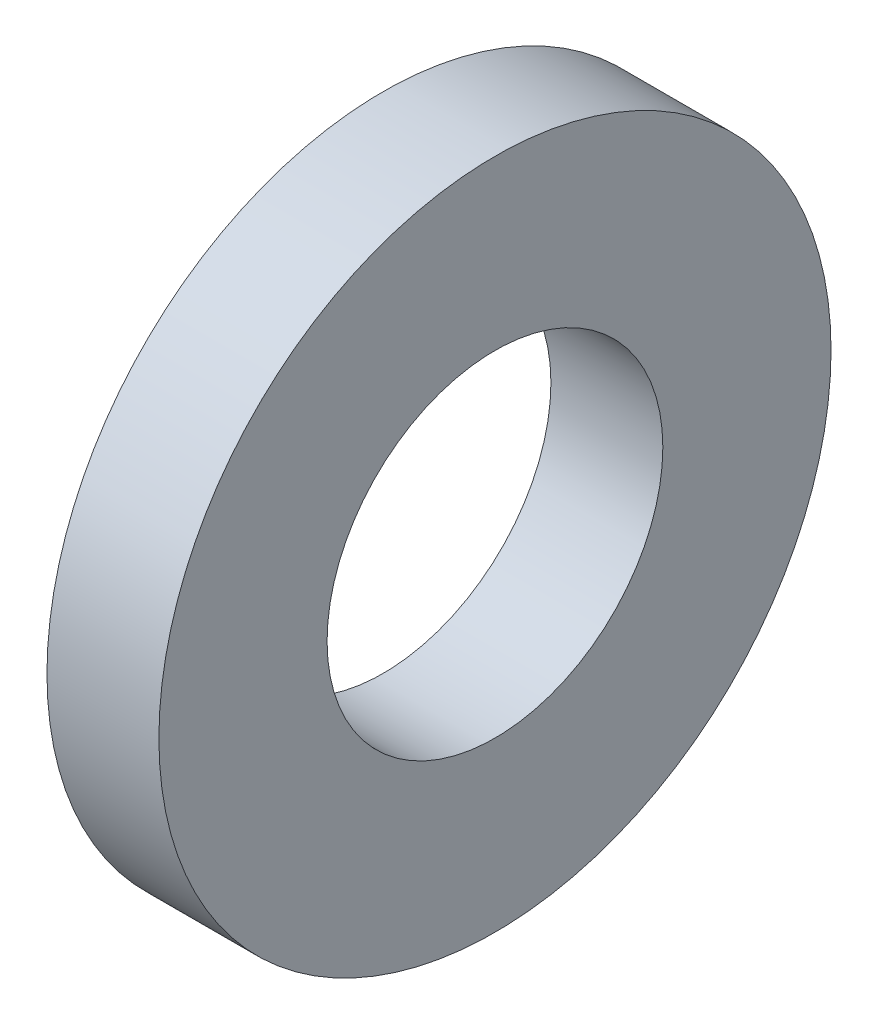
ISO-10303-21;
HEADER;
FILE_DESCRIPTION(('STEP AP214'),'2;1');
FILE_NAME('part.step','',(''),(''),'','','');
FILE_SCHEMA(('AUTOMOTIVE_DESIGN { 1 0 10303 214 1 1 1 1 }'));
ENDSEC;
DATA;
#1=APPLICATION_CONTEXT('core data for automotive mechanical design processes');
#2=APPLICATION_PROTOCOL_DEFINITION('international standard','automotive_design',2000,#1);
#3=PRODUCT_CONTEXT('',#1,'mechanical');
#4=PRODUCT('Part','Part','',(#3));
#5=PRODUCT_RELATED_PRODUCT_CATEGORY('part','',(#4));
#6=PRODUCT_DEFINITION_FORMATION('','',#4);
#7=PRODUCT_DEFINITION_CONTEXT('part definition',#1,'design');
#8=PRODUCT_DEFINITION('design','',#6,#7);
#9=PRODUCT_DEFINITION_SHAPE('','',#8);
#10=(LENGTH_UNIT() NAMED_UNIT(*) SI_UNIT(.MILLI.,.METRE.));
#11=(NAMED_UNIT(*) PLANE_ANGLE_UNIT() SI_UNIT($,.RADIAN.));
#12=(NAMED_UNIT(*) SI_UNIT($,.STERADIAN.) SOLID_ANGLE_UNIT());
#13=UNCERTAINTY_MEASURE_WITH_UNIT(LENGTH_MEASURE(1.E-05),#10,'distance_accuracy_value','');
#14=(GEOMETRIC_REPRESENTATION_CONTEXT(3) GLOBAL_UNCERTAINTY_ASSIGNED_CONTEXT((#13)) GLOBAL_UNIT_ASSIGNED_CONTEXT((#10,
#11,#12)) REPRESENTATION_CONTEXT('',''));
#15=CARTESIAN_POINT('',(0.,0.,0.));
#16=DIRECTION('',(0.,0.,1.));
#17=DIRECTION('',(1.,0.,0.));
#18=AXIS2_PLACEMENT_3D('',#15,#16,#17);
#19=CARTESIAN_POINT('',(0.,6.7437,0.));
#20=DIRECTION('',(1.,0.,0.));
#21=DIRECTION('',(0.,0.,-1.));
#22=AXIS2_PLACEMENT_3D('',#19,#20,#21);
#23=PLANE('',#22);
#24=CARTESIAN_POINT('',(0.,0.,0.));
#25=DIRECTION('',(1.,0.,0.));
#26=DIRECTION('',(0.,0.,-1.));
#27=AXIS2_PLACEMENT_3D('',#24,#25,#26);
#28=CIRCLE('',#27,13.5001);
#29=CARTESIAN_POINT('',(0.,0.,-13.5001));
#30=VERTEX_POINT('',#29);
#31=EDGE_CURVE('E10',#30,#30,#28,.T.);
#32=ORIENTED_EDGE('',*,*,#31,.T.);
#33=EDGE_LOOP('',(#32));
#34=FACE_BOUND('',#33,.T.);
#35=CARTESIAN_POINT('',(0.,0.,0.));
#36=DIRECTION('',(1.,0.,0.));
#37=DIRECTION('',(0.,0.,-1.));
#38=AXIS2_PLACEMENT_3D('',#35,#36,#37);
#39=CIRCLE('',#38,6.7437);
#40=CARTESIAN_POINT('',(0.,0.,-6.7437));
#41=VERTEX_POINT('',#40);
#42=EDGE_CURVE('E51',#41,#41,#39,.T.);
#43=ORIENTED_EDGE('',*,*,#42,.F.);
#44=EDGE_LOOP('',(#43));
#45=FACE_BOUND('',#44,.T.);
#46=ADVANCED_FACE('F37',(#34,#45),#23,.T.);
#47=CARTESIAN_POINT('',(0.,0.,0.));
#48=DIRECTION('',(1.,0.,0.));
#49=DIRECTION('',(0.,0.,-1.));
#50=AXIS2_PLACEMENT_3D('',#47,#48,#49);
#51=CYLINDRICAL_SURFACE('',#50,13.5001);
#52=CARTESIAN_POINT('',(-4.4958,0.,0.));
#53=DIRECTION('',(1.,0.,0.));
#54=DIRECTION('',(0.,0.,-1.));
#55=AXIS2_PLACEMENT_3D('',#52,#53,#54);
#56=CIRCLE('',#55,13.5001);
#57=CARTESIAN_POINT('',(-4.4958,0.,-13.5001));
#58=VERTEX_POINT('',#57);
#59=EDGE_CURVE('E43',#58,#58,#56,.T.);
#60=ORIENTED_EDGE('',*,*,#59,.T.);
#61=EDGE_LOOP('',(#60));
#62=FACE_BOUND('',#61,.T.);
#63=ORIENTED_EDGE('',*,*,#31,.F.);
#64=EDGE_LOOP('',(#63));
#65=FACE_BOUND('',#64,.T.);
#66=ADVANCED_FACE('F61',(#62,#65),#51,.T.);
#67=CARTESIAN_POINT('',(-4.4958,6.7437,0.));
#68=DIRECTION('',(-1.,0.,0.));
#69=DIRECTION('',(0.,0.,1.));
#70=AXIS2_PLACEMENT_3D('',#67,#68,#69);
#71=PLANE('',#70);
#72=CARTESIAN_POINT('',(-4.4958,0.,0.));
#73=DIRECTION('',(1.,0.,0.));
#74=DIRECTION('',(0.,0.,-1.));
#75=AXIS2_PLACEMENT_3D('',#72,#73,#74);
#76=CIRCLE('',#75,6.7437);
#77=CARTESIAN_POINT('',(-4.4958,0.,-6.7437));
#78=VERTEX_POINT('',#77);
#79=EDGE_CURVE('E47',#78,#78,#76,.T.);
#80=ORIENTED_EDGE('',*,*,#79,.T.);
#81=EDGE_LOOP('',(#80));
#82=FACE_BOUND('',#81,.T.);
#83=ORIENTED_EDGE('',*,*,#59,.F.);
#84=EDGE_LOOP('',(#83));
#85=FACE_BOUND('',#84,.T.);
#86=ADVANCED_FACE('F65',(#82,#85),#71,.T.);
#87=CARTESIAN_POINT('',(0.,0.,0.));
#88=DIRECTION('',(1.,0.,0.));
#89=DIRECTION('',(0.,0.,-1.));
#90=AXIS2_PLACEMENT_3D('',#87,#88,#89);
#91=CYLINDRICAL_SURFACE('',#90,6.7437);
#92=ORIENTED_EDGE('',*,*,#42,.T.);
#93=EDGE_LOOP('',(#92));
#94=FACE_BOUND('',#93,.T.);
#95=ORIENTED_EDGE('',*,*,#79,.F.);
#96=EDGE_LOOP('',(#95));
#97=FACE_BOUND('',#96,.T.);
#98=ADVANCED_FACE('F57',(#94,#97),#91,.F.);
#99=CLOSED_SHELL('',(#46,#66,#86,#98));
#100=MANIFOLD_SOLID_BREP('B2',#99);
#101=ADVANCED_BREP_SHAPE_REPRESENTATION('',(#18,#100),#14);
#102=SHAPE_DEFINITION_REPRESENTATION(#9,#101);
ENDSEC;
END-ISO-10303-21;
